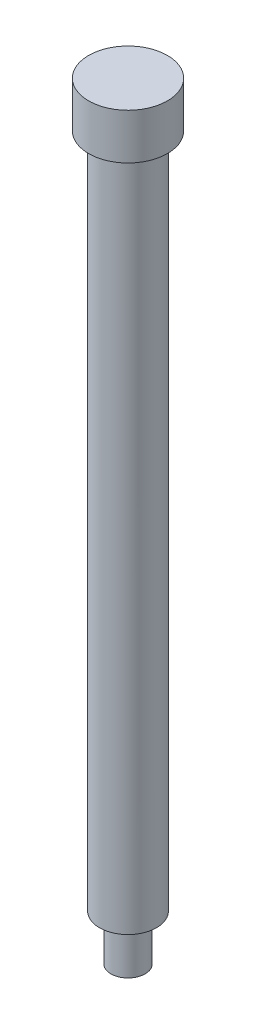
from build123d import *


with BuildPart() as part:
    # Sketch1 → Base-Revolve (revolve)
    with BuildSketch(Plane.XY, mode=Mode.PRIVATE) as base_revolve_sk:
        Polygon((0, 495.471117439), (0, 282.111117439), (-7.9375, 282.111117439), (-7.9375, 482.771117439), (-10.95375, 482.771117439), (-10.95375, 495.471117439), align=None)
    revolve(base_revolve_sk.sketch.rotate(Axis((0, 310.686117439, 0), (0, 1, 0)), 270), axis=Axis((0, 310.686117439, 0), (0, 1, 0)))

    # Sketch2 → 3_8-24 UNF-2A (revolve, cut)
    with BuildSketch(Plane.XY, mode=Mode.PRIVATE) as f_3_8_24_unf_2a_sk:
        with BuildLine():
            Line((-4.7625, 282.111117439), (-7.9375, 282.111117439))
            Line((-7.9375, 282.111117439), (-7.9375, 294.811117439))
            Line((-7.9375, 294.811117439), (-4.7625, 294.811117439))
            ThreePointArc((-4.7625, 294.811117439), (-4.20572412, 294.580493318), (-3.9751, 294.023717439))
            Line((-3.9751, 294.023717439), (-3.9751, 293.668117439))
            ThreePointArc((-3.9751, 293.668117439), (-4.20572412, 293.111341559), (-4.7625, 292.880717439))
            Line((-4.7625, 292.880717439), (-4.7625, 282.111117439))
        make_face()
    revolve(f_3_8_24_unf_2a_sk.sketch.rotate(Axis((0, 498.011117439, 0), (0, -1, 0)), 270), axis=Axis((0, 498.011117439, 0), (0, -1, 0)), mode=Mode.SUBTRACT)


solid = part.part
